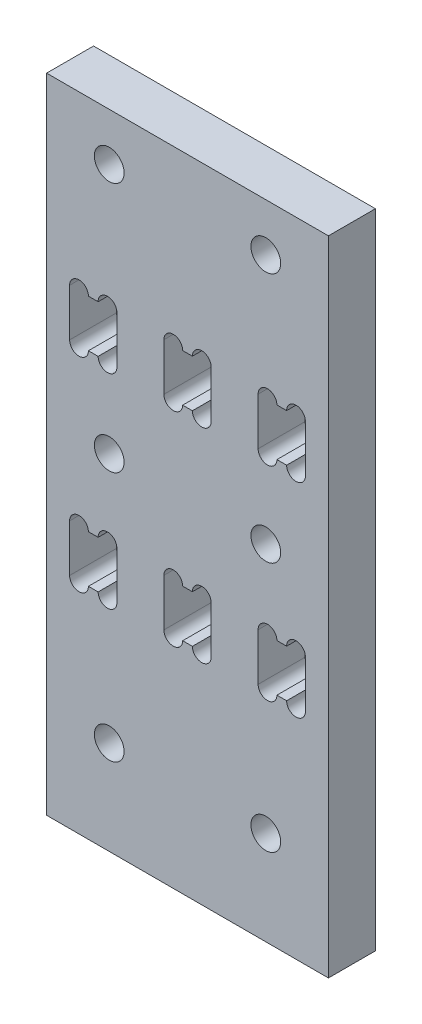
from build123d import *

# Parameters (mm, degrees)
SKIZZE1_W                       = 90
SKIZZE1_H                       = 205.25
SKIZZE1_R                       = 4.75
AUFSATZ_LINEAR_AUSTRAGEN1_DEPTH = 15


with BuildPart() as part:
    # Skizze1 → Aufsatz-Linear austragen1 (new body)
    with BuildSketch(Plane.XY):
        with Locations((45, 102.625)):
            Rectangle(SKIZZE1_W, SKIZZE1_H)
        with Locations((20, 30)):
            Circle(SKIZZE1_R, mode=Mode.SUBTRACT)
        with Locations((70, 30)):
            Circle(SKIZZE1_R, mode=Mode.SUBTRACT)
        with Locations((20, 110)):
            Circle(SKIZZE1_R, mode=Mode.SUBTRACT)
        with Locations((70, 110)):
            Circle(SKIZZE1_R, mode=Mode.SUBTRACT)
        with Locations((20, 190)):
            Circle(SKIZZE1_R, mode=Mode.SUBTRACT)
        with Locations((70, 190)):
            Circle(SKIZZE1_R, mode=Mode.SUBTRACT)
        with BuildLine():
            Line((7.35, 85.1), (7.35, 70))
            ThreePointArc((7.35, 70), (10.35, 67), (13.35, 70))
            Line((13.35, 70), (16.45, 70))
            ThreePointArc((16.45, 70), (19.45, 67), (22.45, 70))
            Line((22.45, 70), (22.45, 85.1))
            ThreePointArc((22.45, 85.1), (19.45, 88.1), (16.45, 85.1))
            Line((16.45, 85.1), (13.35, 85.1))
            ThreePointArc((13.35, 85.1), (10.35, 88.1), (7.35, 85.1))
        make_face(mode=Mode.SUBTRACT)
        with BuildLine():
            Line((37.45, 85.1), (37.45, 70))
            ThreePointArc((37.45, 70), (40.45, 67), (43.45, 70))
            Line((43.45, 70), (46.55, 70))
            ThreePointArc((46.55, 70), (49.55, 67), (52.55, 70))
            Line((52.55, 70), (52.55, 85.1))
            ThreePointArc((52.55, 85.1), (49.55, 88.1), (46.55, 85.1))
            Line((46.55, 85.1), (43.45, 85.1))
            ThreePointArc((43.45, 85.1), (40.45, 88.1), (37.45, 85.1))
        make_face(mode=Mode.SUBTRACT)
        with BuildLine():
            Line((67.55, 85.1), (67.55, 70))
            ThreePointArc((67.55, 70), (70.55, 67), (73.55, 70))
            Line((73.55, 70), (76.65, 70))
            ThreePointArc((76.65, 70), (79.65, 67), (82.65, 70))
            Line((82.65, 70), (82.65, 85.1))
            ThreePointArc((82.65, 85.1), (79.65, 88.1), (76.65, 85.1))
            Line((76.65, 85.1), (73.55, 85.1))
            ThreePointArc((73.55, 85.1), (70.55, 88.1), (67.55, 85.1))
        make_face(mode=Mode.SUBTRACT)
        with BuildLine():
            Line((7.35, 150.25), (7.35, 135.15))
            ThreePointArc((7.35, 135.15), (10.35, 132.15), (13.35, 135.15))
            Line((13.35, 135.15), (16.45, 135.15))
            ThreePointArc((16.45, 135.15), (19.45, 132.15), (22.45, 135.15))
            Line((22.45, 135.15), (22.45, 150.25))
            ThreePointArc((22.45, 150.25), (19.45, 153.25), (16.45, 150.25))
            Line((16.45, 150.25), (13.35, 150.25))
            ThreePointArc((13.35, 150.25), (10.35, 153.25), (7.35, 150.25))
        make_face(mode=Mode.SUBTRACT)
        with BuildLine():
            Line((82.65, 150.25), (82.65, 135.15))
            ThreePointArc((82.65, 135.15), (79.65, 132.15), (76.65, 135.15))
            Line((76.65, 135.15), (73.55, 135.15))
            ThreePointArc((73.55, 135.15), (70.55, 132.15), (67.55, 135.15))
            Line((67.55, 135.15), (67.55, 150.25))
            ThreePointArc((67.55, 150.25), (70.55, 153.25), (73.55, 150.25))
            Line((73.55, 150.25), (76.65, 150.25))
            ThreePointArc((76.65, 150.25), (79.65, 153.25), (82.65, 150.25))
        make_face(mode=Mode.SUBTRACT)
        with BuildLine():
            Line((43.45, 150.25), (46.55, 150.25))
            ThreePointArc((46.55, 150.25), (49.55, 153.25), (52.55, 150.25))
            Line((52.55, 150.25), (52.55, 135.15))
            ThreePointArc((52.55, 135.15), (49.55, 132.15), (46.55, 135.15))
            Line((46.55, 135.15), (43.45, 135.15))
            ThreePointArc((43.45, 135.15), (40.45, 132.15), (37.45, 135.15))
            Line((37.45, 135.15), (37.45, 150.25))
            ThreePointArc((37.45, 150.25), (40.45, 153.25), (43.45, 150.25))
        make_face(mode=Mode.SUBTRACT)
    extrude(amount=AUFSATZ_LINEAR_AUSTRAGEN1_DEPTH)


solid = part.part
